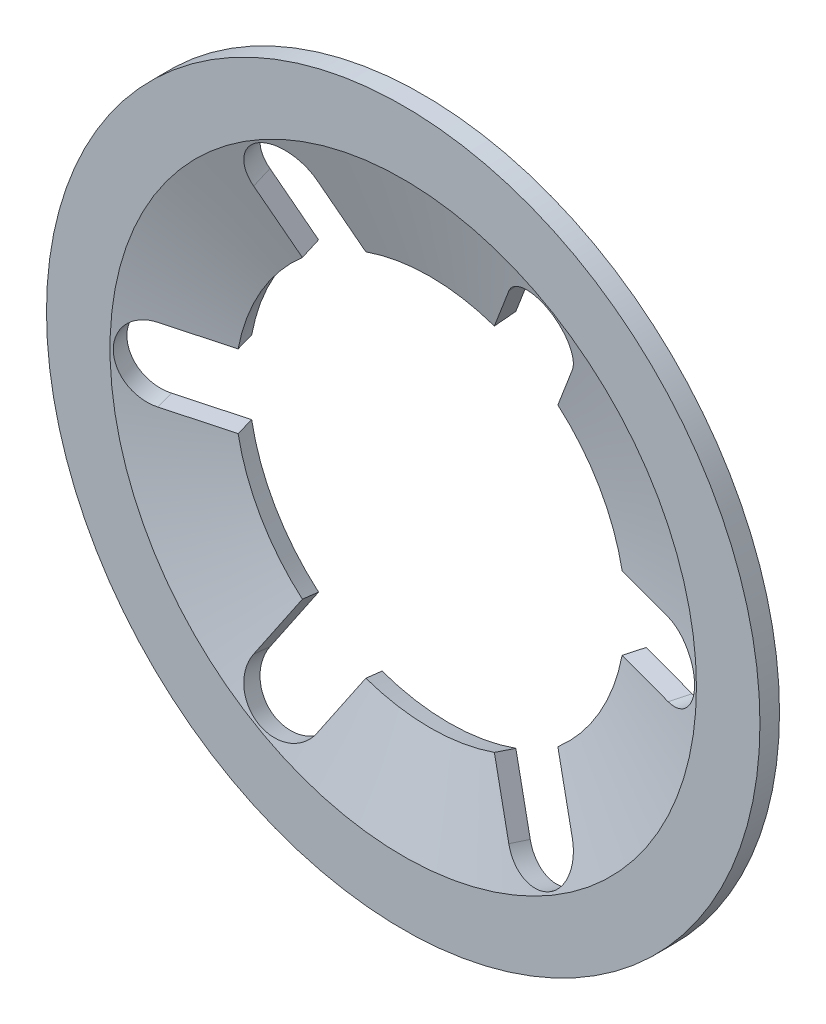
from build123d import *

# Parameters (mm, degrees)
ESQUISSE1_R                  = 7.3
BASE_EXTRUSION_DEPTH         = 0.4
ESQUISSE2_R                  = 6
ENL_V_MAT_EXTRU_1_DEPTH      = 11.331505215
ENL_V_MAT_EXTRU_2_DEPTH      = 15.387534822
R_P_TITION_CIRCULAIRE1_COUNT = 6


with BuildPart() as part:
    # Esquisse1 → Base-Extrusion (new body)
    with BuildSketch(Plane.XY):
        Circle(ESQUISSE1_R)
    extrude(amount=BASE_EXTRUSION_DEPTH)

    # Esquisse2 → Enl_v. mat.-Extru.1 (cut, through all)
    with BuildSketch(Plane.XY.offset(0.4)):
        Circle(ESQUISSE2_R)
    extrude(amount=-ENL_V_MAT_EXTRU_1_DEPTH, mode=Mode.SUBTRACT)

    # Esquisse3 → Boss.-R_vol.-Mince1 (revolve)
    with BuildSketch(Plane(origin=(0, 0, 0), x_dir=(1, 0, 0), z_dir=(0, 1, 0)), mode=Mode.PRIVATE) as boss_r_vol_mince1_sk:
        Polygon((-6, -0.4), (-4, 0.15), (-4.106062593, 0.535682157), (-6.106062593, -0.014317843), align=None)
    revolve(boss_r_vol_mince1_sk.sketch.rotate(Axis((0, 0, -3.197703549), (0, 0, 1)), 180), axis=Axis((0, 0, -3.197703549), (0, 0, 1)))

    # Esquisse5 → Enl_v. mat.-Extru.2 (cut, through all)
    with BuildSketch(Plane(origin=(5.080030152, 0, -0.267841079), x_dir=(0, -1, 0), z_dir=(0.26515648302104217, 0, -0.9642053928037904))):
        with BuildLine():
            Line((-0.75, -0.260124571), (-0.75, 4.827172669))
            Line((-0.75, 4.827172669), (0.75, 4.827172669))
            Line((0.75, 4.827172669), (0.75, -0.260124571))
            ThreePointArc((0.75, -0.260124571), (0, -1.010124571), (-0.75, -0.260124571))
        make_face()
    enl_v_mat_extru_2 = extrude(amount=-ENL_V_MAT_EXTRU_2_DEPTH, mode=Mode.SUBTRACT)

    # R_p_tition circulaire1: Enl_v. mat.-Extru.2 ×6 about axis
    r_p_tition_circulaire1_axis = Axis((0, 0, 0), (0, 0, 1))
    for i in range(1, R_P_TITION_CIRCULAIRE1_COUNT):
        add(enl_v_mat_extru_2.rotate(r_p_tition_circulaire1_axis, i * 360 / R_P_TITION_CIRCULAIRE1_COUNT), mode=Mode.SUBTRACT)


solid = part.part
